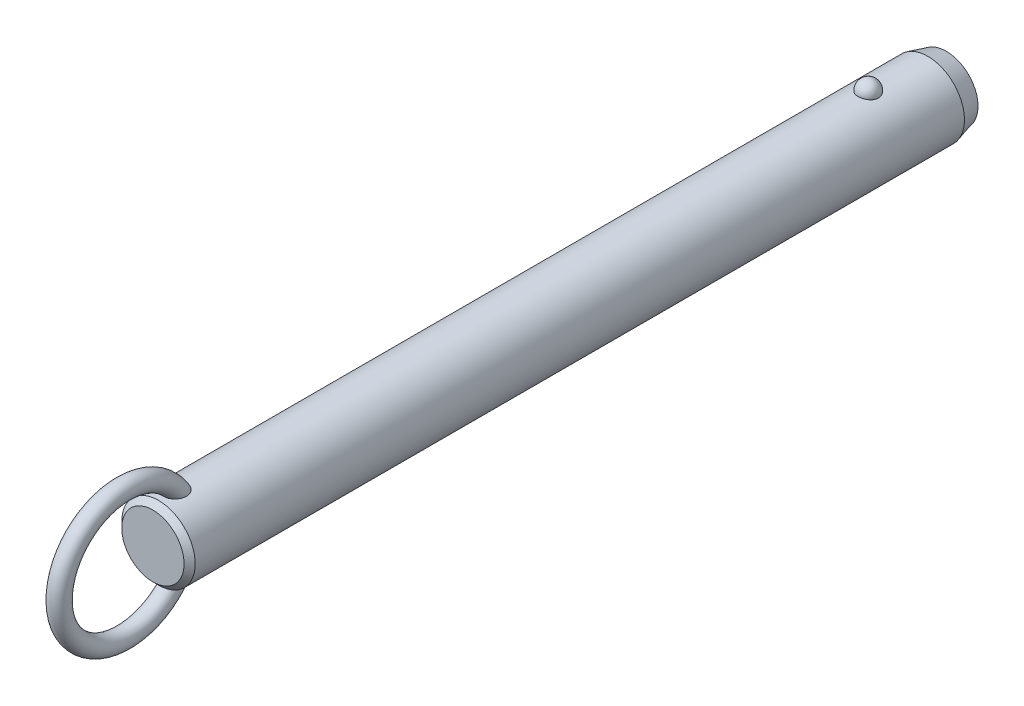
ISO-10303-21;
HEADER;
FILE_DESCRIPTION(('STEP AP214'),'2;1');
FILE_NAME('part.step','',(''),(''),'','','');
FILE_SCHEMA(('AUTOMOTIVE_DESIGN { 1 0 10303 214 1 1 1 1 }'));
ENDSEC;
DATA;
#1=APPLICATION_CONTEXT('core data for automotive mechanical design processes');
#2=APPLICATION_PROTOCOL_DEFINITION('international standard','automotive_design',2000,#1);
#3=PRODUCT_CONTEXT('',#1,'mechanical');
#4=PRODUCT('Part','Part','',(#3));
#5=PRODUCT_RELATED_PRODUCT_CATEGORY('part','',(#4));
#6=PRODUCT_DEFINITION_FORMATION('','',#4);
#7=PRODUCT_DEFINITION_CONTEXT('part definition',#1,'design');
#8=PRODUCT_DEFINITION('design','',#6,#7);
#9=PRODUCT_DEFINITION_SHAPE('','',#8);
#10=(LENGTH_UNIT() NAMED_UNIT(*) SI_UNIT(.MILLI.,.METRE.));
#11=(NAMED_UNIT(*) PLANE_ANGLE_UNIT() SI_UNIT($,.RADIAN.));
#12=(NAMED_UNIT(*) SI_UNIT($,.STERADIAN.) SOLID_ANGLE_UNIT());
#13=UNCERTAINTY_MEASURE_WITH_UNIT(LENGTH_MEASURE(1.E-05),#10,'distance_accuracy_value','');
#14=(GEOMETRIC_REPRESENTATION_CONTEXT(3) GLOBAL_UNCERTAINTY_ASSIGNED_CONTEXT((#13)) GLOBAL_UNIT_ASSIGNED_CONTEXT((#10,
#11,#12)) REPRESENTATION_CONTEXT('',''));
#15=CARTESIAN_POINT('',(0.,0.,0.));
#16=DIRECTION('',(0.,0.,1.));
#17=DIRECTION('',(1.,0.,0.));
#18=AXIS2_PLACEMENT_3D('',#15,#16,#17);
#19=CARTESIAN_POINT('',(0.,0.,142.2));
#20=DIRECTION('',(0.,0.,-1.));
#21=DIRECTION('',(-1.,0.,0.));
#22=AXIS2_PLACEMENT_3D('',#19,#20,#21);
#23=CYLINDRICAL_SURFACE('',#22,7.9);
#24=CARTESIAN_POINT('',(2.1785689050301,7.59367088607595,-2.19999999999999));
#25=CARTESIAN_POINT('',(2.17856679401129,7.59367269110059,-2.07701843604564));
#26=CARTESIAN_POINT('',(2.16853481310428,7.59657145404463,-1.95401006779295));
#27=CARTESIAN_POINT('',(2.12864689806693,7.607843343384,-1.71147811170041));
#28=CARTESIAN_POINT('',(2.09878338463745,7.61621856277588,-1.59195587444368));
#29=CARTESIAN_POINT('',(2.0199931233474,7.63749180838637,-1.3598563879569));
#30=CARTESIAN_POINT('',(1.97107475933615,7.6503878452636,-1.24727610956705));
#31=CARTESIAN_POINT('',(1.85539377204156,7.67926115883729,-1.03213234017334));
#32=CARTESIAN_POINT('',(1.78863158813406,7.69523835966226,-0.929568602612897));
#33=CARTESIAN_POINT('',(1.63856494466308,7.7285848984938,-0.736786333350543));
#34=CARTESIAN_POINT('',(1.55518140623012,7.7459606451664,-0.646630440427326));
#35=CARTESIAN_POINT('',(1.37422937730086,7.78009978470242,-0.481747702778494));
#36=CARTESIAN_POINT('',(1.27666086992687,7.79686317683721,-0.407020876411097));
#37=CARTESIAN_POINT('',(1.07024728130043,7.82786153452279,-0.275278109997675));
#38=CARTESIAN_POINT('',(0.961434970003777,7.84210353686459,-0.218212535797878));
#39=CARTESIAN_POINT('',(0.735351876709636,7.86652194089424,-0.123146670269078));
#40=CARTESIAN_POINT('',(0.618082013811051,7.87669878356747,-0.085144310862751));
#41=CARTESIAN_POINT('',(0.380637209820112,7.89170521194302,-0.0298158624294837));
#42=CARTESIAN_POINT('',(0.260550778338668,7.89662650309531,-0.0121347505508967));
#43=CARTESIAN_POINT('',(0.0190117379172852,7.90090003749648,0.00324379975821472));
#44=CARTESIAN_POINT('',(-0.102440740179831,7.90025280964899,0.00094313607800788));
#45=CARTESIAN_POINT('',(-0.341452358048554,7.89351056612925,-0.0233955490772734));
#46=CARTESIAN_POINT('',(-0.459042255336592,7.88749257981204,-0.0451545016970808));
#47=CARTESIAN_POINT('',(-0.688796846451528,7.87075812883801,-0.107408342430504));
#48=CARTESIAN_POINT('',(-0.800961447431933,7.86004158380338,-0.147903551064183));
#49=CARTESIAN_POINT('',(-1.01743634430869,7.83497131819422,-0.246799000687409));
#50=CARTESIAN_POINT('',(-1.12169791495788,7.82059709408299,-0.305300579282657));
#51=CARTESIAN_POINT('',(-1.31891765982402,7.78976470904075,-0.438549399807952));
#52=CARTESIAN_POINT('',(-1.41187469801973,7.77330633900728,-0.513298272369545));
#53=CARTESIAN_POINT('',(-1.58577142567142,7.73972434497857,-0.678622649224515));
#54=CARTESIAN_POINT('',(-1.66645140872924,7.72259402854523,-0.769470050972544));
#55=CARTESIAN_POINT('',(-1.81161503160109,7.68983776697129,-0.963538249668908));
#56=CARTESIAN_POINT('',(-1.87609753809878,7.6742119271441,-1.06675991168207));
#57=CARTESIAN_POINT('',(-1.98790138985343,7.6460202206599,-1.28401170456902));
#58=CARTESIAN_POINT('',(-2.03501994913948,7.63349104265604,-1.39815107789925));
#59=CARTESIAN_POINT('',(-2.10986724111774,7.6131449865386,-1.63301784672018));
#60=CARTESIAN_POINT('',(-2.1375965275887,7.60532797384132,-1.75374505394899));
#61=CARTESIAN_POINT('',(-2.17289256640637,7.5953195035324,-1.99782562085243));
#62=CARTESIAN_POINT('',(-2.18054294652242,7.59310471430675,-2.12116592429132));
#63=CARTESIAN_POINT('',(-2.17572919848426,7.59448538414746,-2.36741799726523));
#64=CARTESIAN_POINT('',(-2.1632656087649,7.59808068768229,-2.49032977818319));
#65=CARTESIAN_POINT('',(-2.11865035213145,7.61064035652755,-2.73161015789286));
#66=CARTESIAN_POINT('',(-2.08659579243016,7.61957823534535,-2.84999812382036));
#67=CARTESIAN_POINT('',(-2.00367799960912,7.64179982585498,-3.07955956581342));
#68=CARTESIAN_POINT('',(-1.9528140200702,7.65508371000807,-3.19073275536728));
#69=CARTESIAN_POINT('',(-1.83321113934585,7.68460381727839,-3.40337899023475));
#70=CARTESIAN_POINT('',(-1.76437735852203,7.70085556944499,-3.50479651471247));
#71=CARTESIAN_POINT('',(-1.61069526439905,7.73445734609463,-3.69446912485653));
#72=CARTESIAN_POINT('',(-1.52584634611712,7.75180741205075,-3.78272371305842));
#73=CARTESIAN_POINT('',(-1.34198059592,7.78574608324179,-3.94393987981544));
#74=CARTESIAN_POINT('',(-1.24291308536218,7.80233167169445,-4.01684434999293));
#75=CARTESIAN_POINT('',(-1.03352039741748,7.83281625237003,-4.14489386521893));
#76=CARTESIAN_POINT('',(-0.92319600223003,7.84671543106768,-4.20004014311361));
#77=CARTESIAN_POINT('',(-0.695822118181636,7.87011575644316,-4.29042017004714));
#78=CARTESIAN_POINT('',(-0.578872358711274,7.87966903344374,-4.32589112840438));
#79=CARTESIAN_POINT('',(-0.340410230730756,7.8935652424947,-4.37692226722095));
#80=CARTESIAN_POINT('',(-0.218898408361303,7.89790879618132,-4.39248482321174));
#81=CARTESIAN_POINT('',(0.0228107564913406,7.90087453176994,-4.40314405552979));
#82=CARTESIAN_POINT('',(0.142990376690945,7.89960185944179,-4.39861683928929));
#83=CARTESIAN_POINT('',(0.380829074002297,7.89171262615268,-4.37008293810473));
#84=CARTESIAN_POINT('',(0.498488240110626,7.8850962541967,-4.34607694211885));
#85=CARTESIAN_POINT('',(0.727535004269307,7.86726442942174,-4.27939317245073));
#86=CARTESIAN_POINT('',(0.838944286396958,7.85606616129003,-4.236785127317));
#87=CARTESIAN_POINT('',(1.05295421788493,7.83025654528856,-4.13408348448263));
#88=CARTESIAN_POINT('',(1.15555431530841,7.81564498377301,-4.07398879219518));
#89=CARTESIAN_POINT('',(1.35076763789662,7.7843022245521,-3.93687432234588));
#90=CARTESIAN_POINT('',(1.4432046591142,7.76754209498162,-3.85961036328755));
#91=CARTESIAN_POINT('',(1.6139111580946,7.73387857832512,-3.69076949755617));
#92=CARTESIAN_POINT('',(1.6921781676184,7.71697516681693,-3.59919010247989));
#93=CARTESIAN_POINT('',(1.83380875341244,7.6845643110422,-3.40247278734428));
#94=CARTESIAN_POINT('',(1.89689280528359,7.66908588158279,-3.29712873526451));
#95=CARTESIAN_POINT('',(2.0047823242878,7.64159441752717,-3.07707931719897));
#96=CARTESIAN_POINT('',(2.0495945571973,7.62958010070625,-2.96237743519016));
#97=CARTESIAN_POINT('',(2.11580183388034,7.61146617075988,-2.74040519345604));
#98=CARTESIAN_POINT('',(2.13929812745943,7.60484503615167,-2.63379846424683));
#99=CARTESIAN_POINT('',(2.17068242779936,7.59594664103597,-2.41813481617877));
#100=CARTESIAN_POINT('',(2.17857077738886,7.59366928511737,-2.30907795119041));
#101=CARTESIAN_POINT('',(2.1785689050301,7.59367088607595,-2.19999999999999));
#102=B_SPLINE_CURVE_WITH_KNOTS('',3,(#24,#25,#26,#27,#28,#29,#30,#31,#32,#33,#34,#35,#36,#37,
#38,#39,#40,#41,#42,#43,#44,#45,#46,#47,#48,#49,#50,#51,#52,#53,#54,#55,#56,#57,#58,#59,#60,#61,
#62,#63,#64,#65,#66,#67,#68,#69,#70,#71,#72,#73,#74,#75,#76,#77,#78,#79,#80,#81,#82,#83,#84,#85,
#86,#87,#88,#89,#90,#91,#92,#93,#94,#95,#96,#97,#98,#99,#100,#101),.UNSPECIFIED.,.T.,.F.,(4,2,2,
2,2,2,2,2,2,2,2,2,2,2,2,2,2,2,2,2,2,2,2,2,2,2,2,2,2,2,2,2,2,2,2,2,2,2,4),(0.,0.368552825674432,
0.737246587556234,1.10577831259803,1.4743009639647,1.8446206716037,2.21494081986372,
2.5842105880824,2.95344028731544,3.31611630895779,3.67875788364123,4.03628044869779,
4.39380913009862,4.75338791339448,5.11300280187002,5.47939989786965,5.8458226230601,
6.21639834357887,6.58696347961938,6.95598276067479,7.32499216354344,7.69218715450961,
8.0593967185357,8.42858578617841,8.79778880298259,9.16834203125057,9.5388695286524,
9.90482699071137,10.2707407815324,10.6298333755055,10.9889132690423,11.3466585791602,
11.7044262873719,12.0676511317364,12.4309391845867,12.8004764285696,13.1698767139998,
13.4967701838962,13.8236564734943),.UNSPECIFIED.);
#103=CARTESIAN_POINT('',(2.1785689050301,7.59367088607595,-2.19999999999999));
#104=VERTEX_POINT('',#103);
#105=EDGE_CURVE('E41',#104,#104,#102,.T.);
#106=ORIENTED_EDGE('',*,*,#105,.T.);
#107=EDGE_LOOP('',(#106));
#108=FACE_BOUND('',#107,.T.);
#109=CARTESIAN_POINT('',(0.,0.,150.52));
#110=DIRECTION('',(0.,0.,1.));
#111=DIRECTION('',(1.,0.,0.));
#112=AXIS2_PLACEMENT_3D('',#109,#110,#111);
#113=CIRCLE('',#112,7.9);
#114=CARTESIAN_POINT('',(7.9,0.,150.52));
#115=VERTEX_POINT('',#114);
#116=EDGE_CURVE('E10',#115,#115,#113,.F.);
#117=ORIENTED_EDGE('',*,*,#116,.T.);
#118=EDGE_LOOP('',(#117));
#119=FACE_BOUND('',#118,.T.);
#120=CARTESIAN_POINT('',(-0.630969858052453,-7.87476203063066,144.412432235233));
#121=CARTESIAN_POINT('',(-0.734180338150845,-7.86648998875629,144.447285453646));
#122=CARTESIAN_POINT('',(-0.83447695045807,-7.85639291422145,144.490816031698));
#123=CARTESIAN_POINT('',(-1.0262035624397,-7.83366343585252,144.594094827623));
#124=CARTESIAN_POINT('',(-1.1176141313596,-7.82102565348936,144.653877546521));
#125=CARTESIAN_POINT('',(-1.28877277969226,-7.79464922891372,144.787839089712));
#126=CARTESIAN_POINT('',(-1.36854014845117,-7.78091246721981,144.861993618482));
#127=CARTESIAN_POINT('',(-1.51461521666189,-7.75380398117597,145.022494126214));
#128=CARTESIAN_POINT('',(-1.58092966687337,-7.74043207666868,145.108833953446));
#129=CARTESIAN_POINT('',(-1.70019064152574,-7.7151252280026,145.292978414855));
#130=CARTESIAN_POINT('',(-1.75284037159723,-7.70322473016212,145.390979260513));
#131=CARTESIAN_POINT('',(-1.84263464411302,-7.68224112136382,145.594102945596));
#132=CARTESIAN_POINT('',(-1.87977299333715,-7.6731591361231,145.699228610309));
#133=CARTESIAN_POINT('',(-1.94152728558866,-7.65777930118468,145.923284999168));
#134=CARTESIAN_POINT('',(-1.96475471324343,-7.65179654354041,146.042616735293));
#135=CARTESIAN_POINT('',(-1.99449499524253,-7.64409642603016,146.28342986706));
#136=CARTESIAN_POINT('',(-2.0010005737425,-7.64238092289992,146.404912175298));
#137=CARTESIAN_POINT('',(-1.99856014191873,-7.64302120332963,146.668340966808));
#138=CARTESIAN_POINT('',(-1.98680021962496,-7.64611845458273,146.81025654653));
#139=CARTESIAN_POINT('',(-1.94457772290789,-7.65696186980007,147.091118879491));
#140=CARTESIAN_POINT('',(-1.91409393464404,-7.66471330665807,147.230062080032));
#141=CARTESIAN_POINT('',(-1.82768670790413,-7.68582947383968,147.531939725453));
#142=CARTESIAN_POINT('',(-1.76772963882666,-7.70003779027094,147.693686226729));
#143=CARTESIAN_POINT('',(-1.65998501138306,-7.72371550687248,147.927695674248));
#144=CARTESIAN_POINT('',(-1.62107967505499,-7.73200670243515,148.004297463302));
#145=CARTESIAN_POINT('',(-1.53727726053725,-7.7491037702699,148.154079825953));
#146=CARTESIAN_POINT('',(-1.49238215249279,-7.75790947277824,148.227261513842));
#147=CARTESIAN_POINT('',(-1.37397050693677,-7.77993338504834,148.40288382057));
#148=CARTESIAN_POINT('',(-1.29690364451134,-7.79328473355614,148.502955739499));
#149=CARTESIAN_POINT('',(-1.12885487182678,-7.81939266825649,148.690714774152));
#150=CARTESIAN_POINT('',(-1.03789926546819,-7.83215032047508,148.778424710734));
#151=CARTESIAN_POINT('',(-0.869532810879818,-7.85231710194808,148.913414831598));
#152=CARTESIAN_POINT('',(-0.795716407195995,-7.86021093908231,148.965076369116));
#153=CARTESIAN_POINT('',(-0.640813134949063,-7.87434920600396,149.056381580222));
#154=CARTESIAN_POINT('',(-0.559737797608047,-7.88059619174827,149.09604389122));
#155=CARTESIAN_POINT('',(-0.406456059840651,-7.88984116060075,149.154300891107));
#156=CARTESIAN_POINT('',(-0.335227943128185,-7.89321892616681,149.175384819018));
#157=CARTESIAN_POINT('',(-0.190193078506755,-7.89804235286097,149.20541418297));
#158=CARTESIAN_POINT('',(-0.116388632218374,-7.89948969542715,149.214370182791));
#159=CARTESIAN_POINT('',(0.0318414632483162,-7.90028409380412,149.219291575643));
#160=CARTESIAN_POINT('',(0.106268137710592,-7.89962640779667,149.215227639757));
#161=CARTESIAN_POINT('',(0.253290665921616,-7.8962818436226,149.194461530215));
#162=CARTESIAN_POINT('',(0.325885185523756,-7.8935935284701,149.177750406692));
#163=CARTESIAN_POINT('',(0.481441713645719,-7.88577340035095,149.128738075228));
#164=CARTESIAN_POINT('',(0.563611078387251,-7.88026321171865,149.094005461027));
#165=CARTESIAN_POINT('',(0.721129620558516,-7.86741729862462,149.011796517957));
#166=CARTESIAN_POINT('',(0.79646633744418,-7.86007832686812,148.964297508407));
#167=CARTESIAN_POINT('',(0.971456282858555,-7.84073285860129,148.836513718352));
#168=CARTESIAN_POINT('',(1.06719686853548,-7.82809461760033,148.751004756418));
#169=CARTESIAN_POINT('',(1.24418921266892,-7.80192439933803,148.566232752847));
#170=CARTESIAN_POINT('',(1.32540832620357,-7.78839049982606,148.466939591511));
#171=CARTESIAN_POINT('',(1.45199971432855,-7.76559693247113,148.289576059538));
#172=CARTESIAN_POINT('',(1.50085649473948,-7.75626094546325,148.213954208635));
#173=CARTESIAN_POINT('',(1.59197749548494,-7.73807279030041,148.058742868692));
#174=CARTESIAN_POINT('',(1.63423919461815,-7.72922080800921,147.979151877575));
#175=CARTESIAN_POINT('',(1.71222612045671,-7.71231959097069,147.816664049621));
#176=CARTESIAN_POINT('',(1.74794516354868,-7.70427111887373,147.733764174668));
#177=CARTESIAN_POINT('',(1.81270113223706,-7.68929240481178,147.565296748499));
#178=CARTESIAN_POINT('',(1.84173789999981,-7.68236218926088,147.479729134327));
#179=CARTESIAN_POINT('',(1.89322698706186,-7.6698375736,147.30528702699));
#180=CARTESIAN_POINT('',(1.91558744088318,-7.66426199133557,147.216383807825));
#181=CARTESIAN_POINT('',(1.95281367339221,-7.65485915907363,147.036969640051));
#182=CARTESIAN_POINT('',(1.96767946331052,-7.65103190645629,146.946458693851));
#183=CARTESIAN_POINT('',(2.0002145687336,-7.64262981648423,146.673732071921));
#184=CARTESIAN_POINT('',(2.00600691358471,-7.6410871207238,146.489709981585));
#185=CARTESIAN_POINT('',(1.98445334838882,-7.64669564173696,146.176501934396));
#186=CARTESIAN_POINT('',(1.96607186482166,-7.65149688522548,146.046618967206));
#187=CARTESIAN_POINT('',(1.90884967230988,-7.66597624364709,145.791632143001));
#188=CARTESIAN_POINT('',(1.87002101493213,-7.67565148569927,145.666525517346));
#189=CARTESIAN_POINT('',(1.77063986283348,-7.69918471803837,145.42454013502));
#190=CARTESIAN_POINT('',(1.70993724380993,-7.71307150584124,145.307725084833));
#191=CARTESIAN_POINT('',(1.56733070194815,-7.74330306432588,145.088144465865));
#192=CARTESIAN_POINT('',(1.48543692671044,-7.75964665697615,144.985372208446));
#193=CARTESIAN_POINT('',(1.31346177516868,-7.79047523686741,144.809380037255));
#194=CARTESIAN_POINT('',(1.22547278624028,-7.80495298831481,144.734106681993));
#195=CARTESIAN_POINT('',(1.03724352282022,-7.83218597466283,144.600486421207));
#196=CARTESIAN_POINT('',(0.93700840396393,-7.84494192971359,144.542132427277));
#197=CARTESIAN_POINT('',(0.733599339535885,-7.86649045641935,144.447027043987));
#198=CARTESIAN_POINT('',(0.630941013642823,-7.87547134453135,144.409210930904));
#199=CARTESIAN_POINT('',(0.420465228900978,-7.88950708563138,144.351116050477));
#200=CARTESIAN_POINT('',(0.312645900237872,-7.89456050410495,144.33084369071));
#201=CARTESIAN_POINT('',(0.096086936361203,-7.9001518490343,144.308455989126));
#202=CARTESIAN_POINT('',(-0.0126341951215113,-7.90073226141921,144.306169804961));
#203=CARTESIAN_POINT('',(-0.228766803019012,-7.89742350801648,144.319367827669));
#204=CARTESIAN_POINT('',(-0.336180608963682,-7.89354403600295,144.334813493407));
#205=CARTESIAN_POINT('',(-0.473410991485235,-7.88586871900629,144.366217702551));
#206=CARTESIAN_POINT('',(-0.50525779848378,-7.88388984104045,144.374354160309));
#207=CARTESIAN_POINT('',(-0.56848128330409,-7.87958326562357,144.392208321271));
#208=CARTESIAN_POINT('',(-0.59985795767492,-7.87725556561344,144.401926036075));
#209=CARTESIAN_POINT('',(-0.630969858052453,-7.87476203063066,144.412432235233));
#210=B_SPLINE_CURVE_WITH_KNOTS('',3,(#120,#121,#122,#123,#124,#125,#126,#127,#128,#129,#130,
#131,#132,#133,#134,#135,#136,#137,#138,#139,#140,#141,#142,#143,#144,#145,#146,#147,#148,#149,
#150,#151,#152,#153,#154,#155,#156,#157,#158,#159,#160,#161,#162,#163,#164,#165,#166,#167,#168,
#169,#170,#171,#172,#173,#174,#175,#176,#177,#178,#179,#180,#181,#182,#183,#184,#185,#186,#187,
#188,#189,#190,#191,#192,#193,#194,#195,#196,#197,#198,#199,#200,#201,#202,#203,#204,#205,#206,
#207,#208,#209),.UNSPECIFIED.,.T.,.F.,(4,2,2,2,2,2,2,2,2,2,2,2,2,2,2,2,2,2,2,2,2,2,2,2,2,2,2,2,
2,2,2,2,2,2,2,2,2,2,2,2,2,2,2,2,4),(0.,0.327622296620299,0.655945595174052,0.983718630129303,
1.3113267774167,1.64554655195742,1.97989964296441,2.34365728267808,2.70757317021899,
3.13333684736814,3.5595838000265,4.07655306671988,4.33527897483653,4.59391999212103,
4.97382437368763,5.353017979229,5.62348245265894,5.89352465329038,6.11565959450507,
6.33760092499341,6.56004255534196,6.78264174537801,7.04930844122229,7.31645206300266,
7.70130871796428,8.08701995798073,8.35824509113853,8.6295736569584,8.9011573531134,
9.1727474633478,9.44791855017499,9.72308922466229,10.2715298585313,10.6638393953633,
11.0559179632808,11.4507403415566,11.8453740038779,12.1936425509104,12.5417649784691,
12.8695063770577,13.1973674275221,13.5221104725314,13.8461490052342,13.9449071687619,
14.0436660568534),.UNSPECIFIED.);
#211=CARTESIAN_POINT('',(-0.630969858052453,-7.87476203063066,144.412432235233));
#212=VERTEX_POINT('',#211);
#213=EDGE_CURVE('E60',#212,#212,#210,.T.);
#214=ORIENTED_EDGE('',*,*,#213,.T.);
#215=EDGE_LOOP('',(#214));
#216=FACE_BOUND('',#215,.T.);
#217=CARTESIAN_POINT('',(-0.630969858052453,7.87476203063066,144.412432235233));
#218=CARTESIAN_POINT('',(-0.528918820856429,7.88293636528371,144.377979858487));
#219=CARTESIAN_POINT('',(-0.423745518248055,7.88934810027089,144.351915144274));
#220=CARTESIAN_POINT('',(-0.210236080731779,7.8979273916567,144.317282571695));
#221=CARTESIAN_POINT('',(-0.10189380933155,7.90008607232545,144.308751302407));
#222=CARTESIAN_POINT('',(0.114660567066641,7.89990877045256,144.309457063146));
#223=CARTESIAN_POINT('',(0.222872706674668,7.89757640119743,144.31867980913));
#224=CARTESIAN_POINT('',(0.436107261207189,7.88867538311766,144.354652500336));
#225=CARTESIAN_POINT('',(0.541131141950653,7.8821087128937,144.38139425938));
#226=CARTESIAN_POINT('',(0.745085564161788,7.86545130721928,144.451756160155));
#227=CARTESIAN_POINT('',(0.844015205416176,7.85536005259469,144.495378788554));
#228=CARTESIAN_POINT('',(1.03299167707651,7.83275153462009,144.598379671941));
#229=CARTESIAN_POINT('',(1.12303841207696,7.8202342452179,144.657758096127));
#230=CARTESIAN_POINT('',(1.29214734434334,7.79408219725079,144.790864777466));
#231=CARTESIAN_POINT('',(1.37116907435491,7.78044359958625,144.864643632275));
#232=CARTESIAN_POINT('',(1.51597677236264,7.75353170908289,145.024235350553));
#233=CARTESIAN_POINT('',(1.58176261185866,7.74025841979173,145.110048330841));
#234=CARTESIAN_POINT('',(1.70057386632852,7.71504069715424,145.293644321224));
#235=CARTESIAN_POINT('',(1.75320073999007,7.7031425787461,145.391690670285));
#236=CARTESIAN_POINT('',(1.8429376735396,7.68216822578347,145.594893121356));
#237=CARTESIAN_POINT('',(1.88004278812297,7.67309289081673,145.700051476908));
#238=CARTESIAN_POINT('',(1.9417232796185,7.6577294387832,145.924167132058));
#239=CARTESIAN_POINT('',(1.96491037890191,7.65175648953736,146.043524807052));
#240=CARTESIAN_POINT('',(1.9945689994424,7.64407702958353,146.284384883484));
#241=CARTESIAN_POINT('',(2.00103304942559,7.64237242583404,146.40588821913));
#242=CARTESIAN_POINT('',(1.99850166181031,7.64303650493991,146.669368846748));
#243=CARTESIAN_POINT('',(1.98669038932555,7.64614714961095,146.811314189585));
#244=CARTESIAN_POINT('',(1.94436120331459,7.65701701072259,147.092228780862));
#245=CARTESIAN_POINT('',(1.91382203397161,7.66478150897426,147.231194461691));
#246=CARTESIAN_POINT('',(1.82728754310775,7.68592483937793,147.533111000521));
#247=CARTESIAN_POINT('',(1.76725778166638,7.70014685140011,147.694872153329));
#248=CARTESIAN_POINT('',(1.65939700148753,7.72384204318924,147.928891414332));
#249=CARTESIAN_POINT('',(1.62045187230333,7.73213852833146,148.005494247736));
#250=CARTESIAN_POINT('',(1.5365668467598,7.74924489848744,148.155273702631));
#251=CARTESIAN_POINT('',(1.49162892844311,7.75805461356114,148.228451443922));
#252=CARTESIAN_POINT('',(1.37317698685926,7.78007342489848,148.403952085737));
#253=CARTESIAN_POINT('',(1.29612360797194,7.79341423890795,148.503911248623));
#254=CARTESIAN_POINT('',(1.12812043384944,7.81949839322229,148.69145083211));
#255=CARTESIAN_POINT('',(1.03719688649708,7.83224280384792,148.779054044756));
#256=CARTESIAN_POINT('',(0.868871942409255,7.85239026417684,148.91389715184));
#257=CARTESIAN_POINT('',(0.795056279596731,7.86027769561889,148.965511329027));
#258=CARTESIAN_POINT('',(0.640160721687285,7.87440222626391,149.056720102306));
#259=CARTESIAN_POINT('',(0.559092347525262,7.88064188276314,149.096333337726));
#260=CARTESIAN_POINT('',(0.405820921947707,7.8898738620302,149.154505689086));
#261=CARTESIAN_POINT('',(0.334594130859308,7.89324577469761,149.175552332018));
#262=CARTESIAN_POINT('',(0.189568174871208,7.89805733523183,149.205507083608));
#263=CARTESIAN_POINT('',(0.115771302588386,7.89949866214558,149.214425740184));
#264=CARTESIAN_POINT('',(-0.0324359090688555,7.90028156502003,149.21927589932));
#265=CARTESIAN_POINT('',(-0.106847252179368,7.89961843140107,149.215178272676));
#266=CARTESIAN_POINT('',(-0.253834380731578,7.8962642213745,149.194351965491));
#267=CARTESIAN_POINT('',(-0.326408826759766,7.89357170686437,149.177614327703));
#268=CARTESIAN_POINT('',(-0.481962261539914,7.88574179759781,149.128539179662));
#269=CARTESIAN_POINT('',(-0.564145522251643,7.88022507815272,149.093763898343));
#270=CARTESIAN_POINT('',(-0.721685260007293,7.86736646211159,149.011468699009));
#271=CARTESIAN_POINT('',(-0.797029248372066,7.8600213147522,148.963926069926));
#272=CARTESIAN_POINT('',(-0.9720442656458,7.84066026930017,148.836026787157));
#273=CARTESIAN_POINT('',(-1.06779803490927,7.82801274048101,148.750443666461));
#274=CARTESIAN_POINT('',(-1.2448053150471,7.80182621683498,148.565522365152));
#275=CARTESIAN_POINT('',(-1.32602618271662,7.78828530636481,148.466154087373));
#276=CARTESIAN_POINT('',(-1.45259834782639,7.76548487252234,148.288680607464));
#277=CARTESIAN_POINT('',(-1.50143856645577,7.75614818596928,148.213025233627));
#278=CARTESIAN_POINT('',(-1.59252410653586,7.73796020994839,148.057748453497));
#279=CARTESIAN_POINT('',(-1.63476690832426,7.72910910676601,147.978125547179));
#280=CARTESIAN_POINT('',(-1.71271318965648,7.71221133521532,147.815575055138));
#281=CARTESIAN_POINT('',(-1.74841047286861,7.70416543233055,147.732644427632));
#282=CARTESIAN_POINT('',(-1.81311929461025,7.6891937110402,147.564116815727));
#283=CARTESIAN_POINT('',(-1.84213067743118,7.68226791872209,147.478519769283));
#284=CARTESIAN_POINT('',(-1.89356259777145,7.66975461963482,147.304025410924));
#285=CARTESIAN_POINT('',(-1.91589165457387,7.66418586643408,147.215099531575));
#286=CARTESIAN_POINT('',(-1.9530507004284,7.65479859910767,147.035642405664));
#287=CARTESIAN_POINT('',(-1.96788069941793,7.65098008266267,146.945111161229));
#288=CARTESIAN_POINT('',(-2.00030078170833,7.64260704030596,146.672327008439));
#289=CARTESIAN_POINT('',(-2.00600576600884,7.64108760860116,146.488271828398));
#290=CARTESIAN_POINT('',(-1.9842848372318,7.64673945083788,146.175080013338));
#291=CARTESIAN_POINT('',(-1.96583698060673,7.65155751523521,146.045240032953));
#292=CARTESIAN_POINT('',(-1.90848948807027,7.66606613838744,145.790361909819));
#293=CARTESIAN_POINT('',(-1.86960376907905,7.67575338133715,145.665320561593));
#294=CARTESIAN_POINT('',(-1.77013421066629,7.6993013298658,145.423500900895));
#295=CARTESIAN_POINT('',(-1.70940488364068,7.71318991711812,145.306784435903));
#296=CARTESIAN_POINT('',(-1.56672953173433,7.74342495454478,145.087340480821));
#297=CARTESIAN_POINT('',(-1.48478316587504,7.75977144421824,144.98461321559));
#298=CARTESIAN_POINT('',(-1.31266325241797,7.79061163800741,144.808643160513));
#299=CARTESIAN_POINT('',(-1.22456383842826,7.80509908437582,144.733358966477));
#300=CARTESIAN_POINT('',(-1.03622400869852,7.83231881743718,144.599865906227));
#301=CARTESIAN_POINT('',(-0.936015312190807,7.84505551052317,144.541613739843));
#302=CARTESIAN_POINT('',(-0.798824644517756,7.85957802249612,144.477540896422));
#303=CARTESIAN_POINT('',(-0.765787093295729,7.86286821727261,144.463224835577));
#304=CARTESIAN_POINT('',(-0.698939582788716,7.86909211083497,144.436436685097));
#305=CARTESIAN_POINT('',(-0.66512963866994,7.8720258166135,144.423964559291));
#306=CARTESIAN_POINT('',(-0.630969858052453,7.87476203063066,144.412432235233));
#307=B_SPLINE_CURVE_WITH_KNOTS('',3,(#217,#218,#219,#220,#221,#222,#223,#224,#225,#226,#227,
#228,#229,#230,#231,#232,#233,#234,#235,#236,#237,#238,#239,#240,#241,#242,#243,#244,#245,#246,
#247,#248,#249,#250,#251,#252,#253,#254,#255,#256,#257,#258,#259,#260,#261,#262,#263,#264,#265,
#266,#267,#268,#269,#270,#271,#272,#273,#274,#275,#276,#277,#278,#279,#280,#281,#282,#283,#284,
#285,#286,#287,#288,#289,#290,#291,#292,#293,#294,#295,#296,#297,#298,#299,#300,#301,#302,#303,
#304,#305,#306),.UNSPECIFIED.,.T.,.F.,(4,2,2,2,2,2,2,2,2,2,2,2,2,2,2,2,2,2,2,2,2,2,2,2,2,2,2,2,
2,2,2,2,2,2,2,2,2,2,2,2,2,2,2,2,4),(0.,0.323920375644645,0.648516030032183,0.972850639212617,
1.29703380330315,1.62126473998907,1.94549915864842,2.27089401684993,2.5962920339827,
2.93059633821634,3.26500707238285,3.6288164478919,3.99278833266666,4.4186542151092,
4.84500434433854,5.36209210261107,5.62087589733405,5.87957448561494,6.25918598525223,
6.63808782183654,6.90846748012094,7.17842501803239,7.40052350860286,7.6224287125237,
7.84483086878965,8.06739077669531,8.33414615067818,8.60137921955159,8.98641454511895,
9.37230415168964,9.64358673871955,9.91497268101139,10.1866142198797,10.4582620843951,
10.7334745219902,11.008686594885,11.5572126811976,11.9494246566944,12.3413699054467,
12.7359755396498,13.1305875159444,13.4791770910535,13.82687259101,13.9353013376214,
14.0437279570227),.UNSPECIFIED.);
#308=CARTESIAN_POINT('',(-0.630969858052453,7.87476203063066,144.412432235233));
#309=VERTEX_POINT('',#308);
#310=EDGE_CURVE('E67',#309,#309,#307,.T.);
#311=ORIENTED_EDGE('',*,*,#310,.T.);
#312=EDGE_LOOP('',(#311));
#313=FACE_BOUND('',#312,.T.);
#314=CARTESIAN_POINT('',(0.,0.,-15.));
#315=DIRECTION('',(0.,0.,-1.));
#316=DIRECTION('',(-1.,0.,0.));
#317=AXIS2_PLACEMENT_3D('',#314,#315,#316);
#318=CIRCLE('',#317,7.9);
#319=CARTESIAN_POINT('',(-7.9,0.,-15.));
#320=VERTEX_POINT('',#319);
#321=EDGE_CURVE('E57',#320,#320,#318,.F.);
#322=ORIENTED_EDGE('',*,*,#321,.T.);
#323=EDGE_LOOP('',(#322));
#324=FACE_BOUND('',#323,.T.);
#325=ADVANCED_FACE('F37',(#108,#119,#216,#313,#324),#23,.T.);
#326=CARTESIAN_POINT('',(0.,0.,-19.));
#327=DIRECTION('',(0.,0.,-1.));
#328=DIRECTION('',(-1.,0.,0.));
#329=AXIS2_PLACEMENT_3D('',#326,#327,#328);
#330=PLANE('',#329);
#331=CARTESIAN_POINT('',(0.,0.,-19.));
#332=DIRECTION('',(0.,0.,-1.));
#333=DIRECTION('',(-1.,0.,0.));
#334=AXIS2_PLACEMENT_3D('',#331,#332,#333);
#335=CIRCLE('',#334,6.82820323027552);
#336=CARTESIAN_POINT('',(-6.82820323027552,0.,-19.));
#337=VERTEX_POINT('',#336);
#338=EDGE_CURVE('E66',#337,#337,#335,.T.);
#339=ORIENTED_EDGE('',*,*,#338,.T.);
#340=EDGE_LOOP('',(#339));
#341=FACE_BOUND('',#340,.T.);
#342=ADVANCED_FACE('F85',(#341),#330,.T.);
#343=CARTESIAN_POINT('',(0.,0.,-19.));
#344=DIRECTION('',(0.,0.,1.));
#345=DIRECTION('',(1.,0.,0.));
#346=AXIS2_PLACEMENT_3D('',#343,#344,#345);
#347=CONICAL_SURFACE('',#346,6.82820323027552,0.261799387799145);
#348=ORIENTED_EDGE('',*,*,#321,.F.);
#349=EDGE_LOOP('',(#348));
#350=FACE_BOUND('',#349,.T.);
#351=ORIENTED_EDGE('',*,*,#338,.F.);
#352=EDGE_LOOP('',(#351));
#353=FACE_BOUND('',#352,.T.);
#354=ADVANCED_FACE('F83',(#350,#353),#347,.T.);
#355=CARTESIAN_POINT('',(0.,0.,151.72));
#356=DIRECTION('',(0.,0.,1.));
#357=DIRECTION('',(1.,0.,0.));
#358=AXIS2_PLACEMENT_3D('',#355,#356,#357);
#359=PLANE('',#358);
#360=CARTESIAN_POINT('',(0.,0.,151.72));
#361=DIRECTION('',(0.,0.,1.));
#362=DIRECTION('',(1.,0.,0.));
#363=AXIS2_PLACEMENT_3D('',#360,#361,#362);
#364=CIRCLE('',#363,6.69999999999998);
#365=CARTESIAN_POINT('',(6.69999999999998,0.,151.72));
#366=VERTEX_POINT('',#365);
#367=EDGE_CURVE('E50',#366,#366,#364,.T.);
#368=ORIENTED_EDGE('',*,*,#367,.T.);
#369=EDGE_LOOP('',(#368));
#370=FACE_BOUND('',#369,.T.);
#371=ADVANCED_FACE('F77',(#370),#359,.T.);
#372=CARTESIAN_POINT('',(0.,0.,158.05));
#373=DIRECTION('',(1.,0.,0.));
#374=DIRECTION('',(0.,0.,-1.));
#375=AXIS2_PLACEMENT_3D('',#372,#373,#374);
#376=TOROIDAL_SURFACE('',#375,13.85,2.);
#377=ORIENTED_EDGE('',*,*,#310,.F.);
#378=EDGE_LOOP('',(#377));
#379=FACE_BOUND('',#378,.T.);
#380=ORIENTED_EDGE('',*,*,#213,.F.);
#381=EDGE_LOOP('',(#380));
#382=FACE_BOUND('',#381,.T.);
#383=ADVANCED_FACE('F73',(#379,#382),#376,.T.);
#384=CARTESIAN_POINT('',(0.,0.,151.72));
#385=DIRECTION('',(0.,0.,-1.));
#386=DIRECTION('',(-1.,0.,0.));
#387=AXIS2_PLACEMENT_3D('',#384,#385,#386);
#388=CONICAL_SURFACE('',#387,6.69999999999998,0.785398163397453);
#389=ORIENTED_EDGE('',*,*,#116,.F.);
#390=EDGE_LOOP('',(#389));
#391=FACE_BOUND('',#390,.T.);
#392=ORIENTED_EDGE('',*,*,#367,.F.);
#393=EDGE_LOOP('',(#392));
#394=FACE_BOUND('',#393,.T.);
#395=ADVANCED_FACE('F39',(#391,#394),#388,.T.);
#396=CARTESIAN_POINT('',(0.,7.9,-2.19999999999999));
#397=DIRECTION('',(0.,1.,0.));
#398=DIRECTION('',(0.,0.,-1.));
#399=AXIS2_PLACEMENT_3D('',#396,#397,#398);
#400=SPHERICAL_SURFACE('',#399,2.2);
#401=ORIENTED_EDGE('',*,*,#105,.F.);
#402=EDGE_LOOP('',(#401));
#403=FACE_BOUND('',#402,.T.);
#404=ADVANCED_FACE('F79',(#403),#400,.T.);
#405=CLOSED_SHELL('',(#325,#342,#354,#371,#383,#395,#404));
#406=MANIFOLD_SOLID_BREP('B2',#405);
#407=ADVANCED_BREP_SHAPE_REPRESENTATION('',(#18,#406),#14);
#408=SHAPE_DEFINITION_REPRESENTATION(#9,#407);
ENDSEC;
END-ISO-10303-21;
